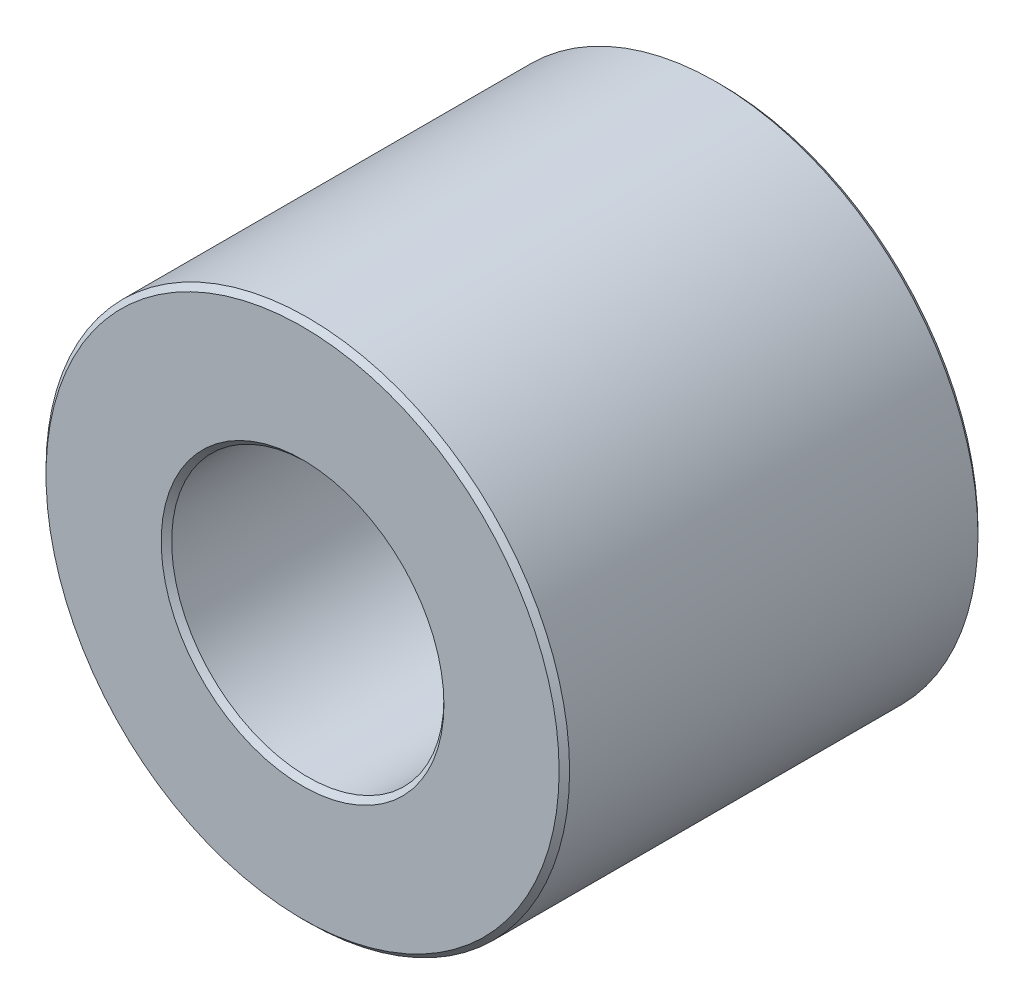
from build123d import *

# Parameters (mm, degrees)
SKETCH1_R           = 5
SKETCH1_R_2         = 2.6
BOSS_EXTRUDE2_DEPTH = 4
CHAMFER3_SIZE       = 0.1


with BuildPart() as part:
    # Sketch1 → Boss-Extrude2 (new, symmetric)
    with BuildSketch(Plane.XY):
        Circle(SKETCH1_R)
        Circle(SKETCH1_R_2, mode=Mode.SUBTRACT)
    extrude(amount=BOSS_EXTRUDE2_DEPTH, both=True)

    # Chamfer3
    chamfer3_edges = [part.edges().sort_by_distance(p)[0] for p in [
        (-5, 0, -4),
        (-5, 0, 4),
        (-2.6, 0, -4),
        (-2.6, 0, 4),
    ]]
    chamfer(chamfer3_edges, length=CHAMFER3_SIZE)


solid = part.part
